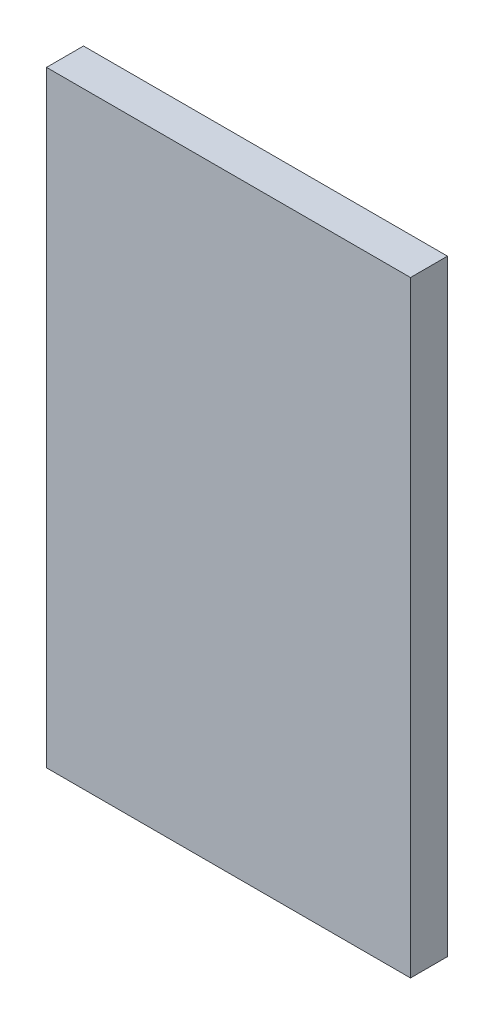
ISO-10303-21;
HEADER;
FILE_DESCRIPTION(('STEP AP214'),'2;1');
FILE_NAME('part.step','',(''),(''),'','','');
FILE_SCHEMA(('AUTOMOTIVE_DESIGN { 1 0 10303 214 1 1 1 1 }'));
ENDSEC;
DATA;
#1=APPLICATION_CONTEXT('core data for automotive mechanical design processes');
#2=APPLICATION_PROTOCOL_DEFINITION('international standard','automotive_design',2000,#1);
#3=PRODUCT_CONTEXT('',#1,'mechanical');
#4=PRODUCT('Part','Part','',(#3));
#5=PRODUCT_RELATED_PRODUCT_CATEGORY('part','',(#4));
#6=PRODUCT_DEFINITION_FORMATION('','',#4);
#7=PRODUCT_DEFINITION_CONTEXT('part definition',#1,'design');
#8=PRODUCT_DEFINITION('design','',#6,#7);
#9=PRODUCT_DEFINITION_SHAPE('','',#8);
#10=(LENGTH_UNIT() NAMED_UNIT(*) SI_UNIT(.MILLI.,.METRE.));
#11=(NAMED_UNIT(*) PLANE_ANGLE_UNIT() SI_UNIT($,.RADIAN.));
#12=(NAMED_UNIT(*) SI_UNIT($,.STERADIAN.) SOLID_ANGLE_UNIT());
#13=UNCERTAINTY_MEASURE_WITH_UNIT(LENGTH_MEASURE(1.E-05),#10,'distance_accuracy_value','');
#14=(GEOMETRIC_REPRESENTATION_CONTEXT(3) GLOBAL_UNCERTAINTY_ASSIGNED_CONTEXT((#13)) GLOBAL_UNIT_ASSIGNED_CONTEXT((#10,
#11,#12)) REPRESENTATION_CONTEXT('',''));
#15=CARTESIAN_POINT('',(0.,0.,0.));
#16=DIRECTION('',(0.,0.,1.));
#17=DIRECTION('',(1.,0.,0.));
#18=AXIS2_PLACEMENT_3D('',#15,#16,#17);
#19=CARTESIAN_POINT('',(1.95,10.95,-0.03048));
#20=DIRECTION('',(0.,-1.,0.));
#21=DIRECTION('',(0.,0.,-1.));
#22=AXIS2_PLACEMENT_3D('',#19,#20,#21);
#23=PLANE('',#22);
#24=DIRECTION('',(1.,0.,0.));
#25=VECTOR('',#24,1.);
#26=CARTESIAN_POINT('',(2.1,10.95,0.));
#27=LINE('',#26,#25);
#28=CARTESIAN_POINT('',(1.95,10.95,0.));
#29=VERTEX_POINT('',#28);
#30=CARTESIAN_POINT('',(2.25,10.95,0.));
#31=VERTEX_POINT('',#30);
#32=EDGE_CURVE('E73',#29,#31,#27,.T.);
#33=ORIENTED_EDGE('',*,*,#32,.T.);
#34=DIRECTION('',(0.,0.,-1.));
#35=VECTOR('',#34,1.);
#36=CARTESIAN_POINT('',(2.25,10.95,-0.01524));
#37=LINE('',#36,#35);
#38=CARTESIAN_POINT('',(2.25,10.95,-0.03048));
#39=VERTEX_POINT('',#38);
#40=EDGE_CURVE('E111',#31,#39,#37,.T.);
#41=ORIENTED_EDGE('',*,*,#40,.T.);
#42=DIRECTION('',(1.,0.,0.));
#43=VECTOR('',#42,1.);
#44=CARTESIAN_POINT('',(1.95,10.95,-0.03048));
#45=LINE('',#44,#43);
#46=CARTESIAN_POINT('',(1.95,10.95,-0.03048));
#47=VERTEX_POINT('',#46);
#48=EDGE_CURVE('E75',#47,#39,#45,.T.);
#49=ORIENTED_EDGE('',*,*,#48,.F.);
#50=DIRECTION('',(0.,0.,-1.));
#51=VECTOR('',#50,1.);
#52=CARTESIAN_POINT('',(1.95,10.95,-0.01524));
#53=LINE('',#52,#51);
#54=EDGE_CURVE('E11',#29,#47,#53,.T.);
#55=ORIENTED_EDGE('',*,*,#54,.F.);
#56=EDGE_LOOP('',(#33,#41,#49,#55));
#57=FACE_BOUND('',#56,.T.);
#58=ADVANCED_FACE('F17',(#57),#23,.F.);
#59=CARTESIAN_POINT('',(1.95,10.45,-0.03048));
#60=DIRECTION('',(1.,0.,0.));
#61=DIRECTION('',(0.,1.,0.));
#62=AXIS2_PLACEMENT_3D('',#59,#60,#61);
#63=PLANE('',#62);
#64=DIRECTION('',(0.,1.,0.));
#65=VECTOR('',#64,1.);
#66=CARTESIAN_POINT('',(1.95,10.7,0.));
#67=LINE('',#66,#65);
#68=CARTESIAN_POINT('',(1.95,10.45,0.));
#69=VERTEX_POINT('',#68);
#70=EDGE_CURVE('E79',#69,#29,#67,.T.);
#71=ORIENTED_EDGE('',*,*,#70,.T.);
#72=ORIENTED_EDGE('',*,*,#54,.T.);
#73=DIRECTION('',(0.,1.,0.));
#74=VECTOR('',#73,1.);
#75=CARTESIAN_POINT('',(1.95,10.45,-0.03048));
#76=LINE('',#75,#74);
#77=CARTESIAN_POINT('',(1.95,10.45,-0.03048));
#78=VERTEX_POINT('',#77);
#79=EDGE_CURVE('E108',#78,#47,#76,.T.);
#80=ORIENTED_EDGE('',*,*,#79,.F.);
#81=DIRECTION('',(0.,0.,-1.));
#82=VECTOR('',#81,1.);
#83=CARTESIAN_POINT('',(1.95,10.45,-0.01524));
#84=LINE('',#83,#82);
#85=EDGE_CURVE('E25',#69,#78,#84,.T.);
#86=ORIENTED_EDGE('',*,*,#85,.F.);
#87=EDGE_LOOP('',(#71,#72,#80,#86));
#88=FACE_BOUND('',#87,.T.);
#89=ADVANCED_FACE('F80',(#88),#63,.F.);
#90=CARTESIAN_POINT('',(2.25,10.45,-0.03048));
#91=DIRECTION('',(0.,1.,0.));
#92=DIRECTION('',(1.,0.,0.));
#93=AXIS2_PLACEMENT_3D('',#90,#91,#92);
#94=PLANE('',#93);
#95=DIRECTION('',(-1.,0.,0.));
#96=VECTOR('',#95,1.);
#97=CARTESIAN_POINT('',(2.1,10.45,0.));
#98=LINE('',#97,#96);
#99=CARTESIAN_POINT('',(2.25,10.45,0.));
#100=VERTEX_POINT('',#99);
#101=EDGE_CURVE('E84',#100,#69,#98,.T.);
#102=ORIENTED_EDGE('',*,*,#101,.T.);
#103=ORIENTED_EDGE('',*,*,#85,.T.);
#104=DIRECTION('',(-1.,0.,0.));
#105=VECTOR('',#104,1.);
#106=CARTESIAN_POINT('',(2.25,10.45,-0.03048));
#107=LINE('',#106,#105);
#108=CARTESIAN_POINT('',(2.25,10.45,-0.03048));
#109=VERTEX_POINT('',#108);
#110=EDGE_CURVE('E102',#109,#78,#107,.T.);
#111=ORIENTED_EDGE('',*,*,#110,.F.);
#112=DIRECTION('',(0.,0.,-1.));
#113=VECTOR('',#112,1.);
#114=CARTESIAN_POINT('',(2.25,10.45,-0.01524));
#115=LINE('',#114,#113);
#116=EDGE_CURVE('E46',#100,#109,#115,.T.);
#117=ORIENTED_EDGE('',*,*,#116,.F.);
#118=EDGE_LOOP('',(#102,#103,#111,#117));
#119=FACE_BOUND('',#118,.T.);
#120=ADVANCED_FACE('F142',(#119),#94,.F.);
#121=CARTESIAN_POINT('',(2.25,10.95,-0.03048));
#122=DIRECTION('',(-1.,0.,0.));
#123=DIRECTION('',(0.,0.,1.));
#124=AXIS2_PLACEMENT_3D('',#121,#122,#123);
#125=PLANE('',#124);
#126=DIRECTION('',(0.,-1.,0.));
#127=VECTOR('',#126,1.);
#128=CARTESIAN_POINT('',(2.25,10.7,0.));
#129=LINE('',#128,#127);
#130=EDGE_CURVE('E88',#31,#100,#129,.T.);
#131=ORIENTED_EDGE('',*,*,#130,.T.);
#132=ORIENTED_EDGE('',*,*,#116,.T.);
#133=DIRECTION('',(0.,-1.,0.));
#134=VECTOR('',#133,1.);
#135=CARTESIAN_POINT('',(2.25,10.95,-0.03048));
#136=LINE('',#135,#134);
#137=EDGE_CURVE('E98',#39,#109,#136,.T.);
#138=ORIENTED_EDGE('',*,*,#137,.F.);
#139=ORIENTED_EDGE('',*,*,#40,.F.);
#140=EDGE_LOOP('',(#131,#132,#138,#139));
#141=FACE_BOUND('',#140,.T.);
#142=ADVANCED_FACE('F133',(#141),#125,.F.);
#143=CARTESIAN_POINT('',(2.1,10.7,-0.03048));
#144=DIRECTION('',(0.,0.,1.));
#145=DIRECTION('',(1.,0.,0.));
#146=AXIS2_PLACEMENT_3D('',#143,#144,#145);
#147=PLANE('',#146);
#148=ORIENTED_EDGE('',*,*,#48,.T.);
#149=ORIENTED_EDGE('',*,*,#137,.T.);
#150=ORIENTED_EDGE('',*,*,#110,.T.);
#151=ORIENTED_EDGE('',*,*,#79,.T.);
#152=EDGE_LOOP('',(#148,#149,#150,#151));
#153=FACE_BOUND('',#152,.T.);
#154=ADVANCED_FACE('F124',(#153),#147,.F.);
#155=CARTESIAN_POINT('',(2.1,10.7,0.));
#156=DIRECTION('',(0.,0.,1.));
#157=DIRECTION('',(1.,0.,0.));
#158=AXIS2_PLACEMENT_3D('',#155,#156,#157);
#159=PLANE('',#158);
#160=ORIENTED_EDGE('',*,*,#32,.F.);
#161=ORIENTED_EDGE('',*,*,#70,.F.);
#162=ORIENTED_EDGE('',*,*,#101,.F.);
#163=ORIENTED_EDGE('',*,*,#130,.F.);
#164=EDGE_LOOP('',(#160,#161,#162,#163));
#165=FACE_BOUND('',#164,.T.);
#166=ADVANCED_FACE('F87',(#165),#159,.T.);
#167=CLOSED_SHELL('',(#58,#89,#120,#142,#154,#166));
#168=MANIFOLD_SOLID_BREP('B1',#167);
#169=ADVANCED_BREP_SHAPE_REPRESENTATION('',(#18,#168),#14);
#170=SHAPE_DEFINITION_REPRESENTATION(#9,#169);
ENDSEC;
END-ISO-10303-21;
